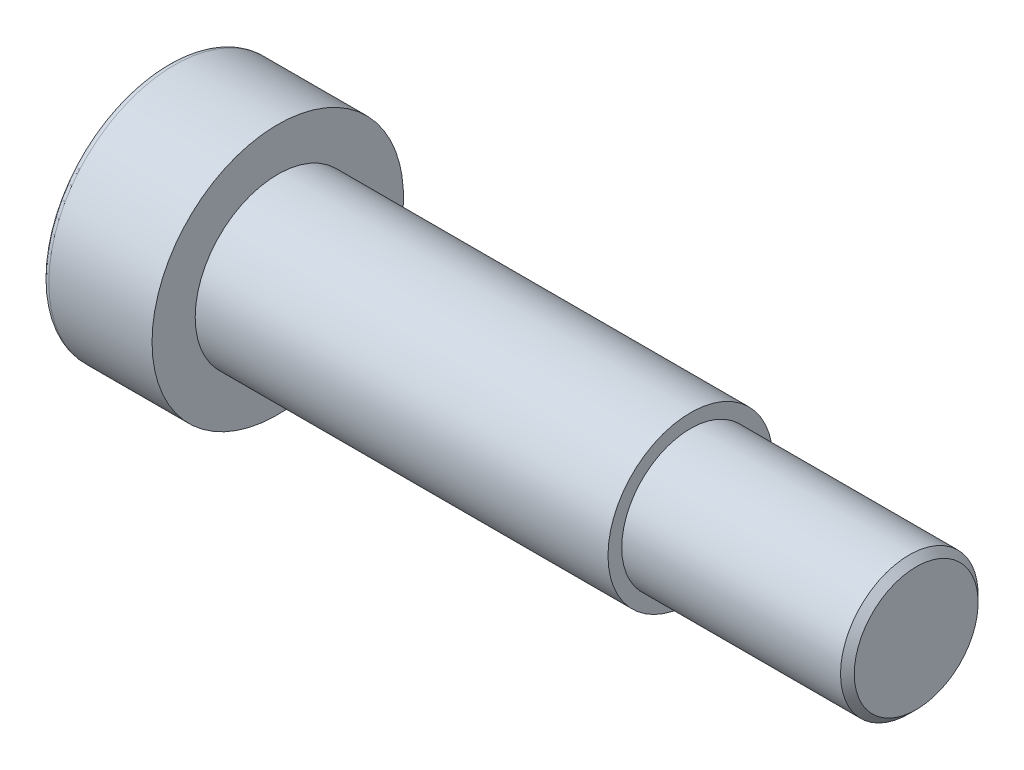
ISO-10303-21;
HEADER;
FILE_DESCRIPTION(('STEP AP214'),'2;1');
FILE_NAME('part.step','',(''),(''),'','','');
FILE_SCHEMA(('AUTOMOTIVE_DESIGN { 1 0 10303 214 1 1 1 1 }'));
ENDSEC;
DATA;
#1=APPLICATION_CONTEXT('core data for automotive mechanical design processes');
#2=APPLICATION_PROTOCOL_DEFINITION('international standard','automotive_design',2000,#1);
#3=PRODUCT_CONTEXT('',#1,'mechanical');
#4=PRODUCT('Part','Part','',(#3));
#5=PRODUCT_RELATED_PRODUCT_CATEGORY('part','',(#4));
#6=PRODUCT_DEFINITION_FORMATION('','',#4);
#7=PRODUCT_DEFINITION_CONTEXT('part definition',#1,'design');
#8=PRODUCT_DEFINITION('design','',#6,#7);
#9=PRODUCT_DEFINITION_SHAPE('','',#8);
#10=(LENGTH_UNIT() NAMED_UNIT(*) SI_UNIT(.MILLI.,.METRE.));
#11=(NAMED_UNIT(*) PLANE_ANGLE_UNIT() SI_UNIT($,.RADIAN.));
#12=(NAMED_UNIT(*) SI_UNIT($,.STERADIAN.) SOLID_ANGLE_UNIT());
#13=UNCERTAINTY_MEASURE_WITH_UNIT(LENGTH_MEASURE(1.E-05),#10,'distance_accuracy_value','');
#14=(GEOMETRIC_REPRESENTATION_CONTEXT(3) GLOBAL_UNCERTAINTY_ASSIGNED_CONTEXT((#13)) GLOBAL_UNIT_ASSIGNED_CONTEXT((#10,
#11,#12)) REPRESENTATION_CONTEXT('',''));
#15=CARTESIAN_POINT('',(0.,0.,0.));
#16=DIRECTION('',(0.,0.,1.));
#17=DIRECTION('',(1.,0.,0.));
#18=AXIS2_PLACEMENT_3D('',#15,#16,#17);
#19=CARTESIAN_POINT('',(54.4,5.,0.));
#20=DIRECTION('',(-1.,0.,0.));
#21=DIRECTION('',(0.,0.,1.));
#22=AXIS2_PLACEMENT_3D('',#19,#20,#21);
#23=PLANE('',#22);
#24=CARTESIAN_POINT('',(54.4,0.,0.));
#25=DIRECTION('',(-1.,0.,0.));
#26=DIRECTION('',(0.,0.,1.));
#27=AXIS2_PLACEMENT_3D('',#24,#25,#26);
#28=CIRCLE('',#27,4.50000000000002);
#29=CARTESIAN_POINT('',(54.4,0.,4.50000000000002));
#30=VERTEX_POINT('',#29);
#31=EDGE_CURVE('E157',#30,#30,#28,.F.);
#32=ORIENTED_EDGE('',*,*,#31,.T.);
#33=EDGE_LOOP('',(#32));
#34=FACE_BOUND('',#33,.T.);
#35=ADVANCED_FACE('F34',(#34),#23,.F.);
#36=CARTESIAN_POINT('',(-16.7790823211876,0.,0.));
#37=DIRECTION('',(-1.,0.,0.));
#38=DIRECTION('',(0.,0.,1.));
#39=AXIS2_PLACEMENT_3D('',#36,#37,#38);
#40=CYLINDRICAL_SURFACE('',#39,5.);
#41=CARTESIAN_POINT('',(53.9,0.,0.));
#42=DIRECTION('',(-1.,0.,0.));
#43=DIRECTION('',(0.,0.,1.));
#44=AXIS2_PLACEMENT_3D('',#41,#42,#43);
#45=CIRCLE('',#44,5.);
#46=CARTESIAN_POINT('',(53.9,0.,5.));
#47=VERTEX_POINT('',#46);
#48=EDGE_CURVE('E154',#47,#47,#45,.T.);
#49=ORIENTED_EDGE('',*,*,#48,.T.);
#50=EDGE_LOOP('',(#49));
#51=FACE_BOUND('',#50,.T.);
#52=CARTESIAN_POINT('',(38.,0.,0.));
#53=DIRECTION('',(-1.,0.,0.));
#54=DIRECTION('',(0.,0.,1.));
#55=AXIS2_PLACEMENT_3D('',#52,#53,#54);
#56=CIRCLE('',#55,5.);
#57=CARTESIAN_POINT('',(38.,0.,5.));
#58=VERTEX_POINT('',#57);
#59=EDGE_CURVE('E151',#58,#58,#56,.T.);
#60=ORIENTED_EDGE('',*,*,#59,.F.);
#61=EDGE_LOOP('',(#60));
#62=FACE_BOUND('',#61,.T.);
#63=ADVANCED_FACE('F178',(#51,#62),#40,.T.);
#64=CARTESIAN_POINT('',(38.,6.,0.));
#65=DIRECTION('',(-1.,0.,0.));
#66=DIRECTION('',(0.,0.,1.));
#67=AXIS2_PLACEMENT_3D('',#64,#65,#66);
#68=PLANE('',#67);
#69=CARTESIAN_POINT('',(38.,0.,0.));
#70=DIRECTION('',(-1.,0.,0.));
#71=DIRECTION('',(0.,0.,1.));
#72=AXIS2_PLACEMENT_3D('',#69,#70,#71);
#73=CIRCLE('',#72,6.);
#74=CARTESIAN_POINT('',(38.,0.,6.));
#75=VERTEX_POINT('',#74);
#76=EDGE_CURVE('E148',#75,#75,#73,.T.);
#77=ORIENTED_EDGE('',*,*,#76,.F.);
#78=EDGE_LOOP('',(#77));
#79=FACE_BOUND('',#78,.T.);
#80=ORIENTED_EDGE('',*,*,#59,.T.);
#81=EDGE_LOOP('',(#80));
#82=FACE_BOUND('',#81,.T.);
#83=ADVANCED_FACE('F183',(#79,#82),#68,.F.);
#84=CARTESIAN_POINT('',(-16.7790823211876,0.,0.));
#85=DIRECTION('',(-1.,0.,0.));
#86=DIRECTION('',(0.,0.,1.));
#87=AXIS2_PLACEMENT_3D('',#84,#85,#86);
#88=CYLINDRICAL_SURFACE('',#87,6.);
#89=CARTESIAN_POINT('',(8.,0.,0.));
#90=DIRECTION('',(-1.,0.,0.));
#91=DIRECTION('',(0.,0.,1.));
#92=AXIS2_PLACEMENT_3D('',#89,#90,#91);
#93=CIRCLE('',#92,6.);
#94=CARTESIAN_POINT('',(8.,0.,6.));
#95=VERTEX_POINT('',#94);
#96=EDGE_CURVE('E145',#95,#95,#93,.T.);
#97=ORIENTED_EDGE('',*,*,#96,.F.);
#98=EDGE_LOOP('',(#97));
#99=FACE_BOUND('',#98,.T.);
#100=ORIENTED_EDGE('',*,*,#76,.T.);
#101=EDGE_LOOP('',(#100));
#102=FACE_BOUND('',#101,.T.);
#103=ADVANCED_FACE('F192',(#99,#102),#88,.T.);
#104=CARTESIAN_POINT('',(8.,9.135,0.));
#105=DIRECTION('',(-1.,0.,0.));
#106=DIRECTION('',(0.,0.,1.));
#107=AXIS2_PLACEMENT_3D('',#104,#105,#106);
#108=PLANE('',#107);
#109=CARTESIAN_POINT('',(8.,0.,0.));
#110=DIRECTION('',(-1.,0.,0.));
#111=DIRECTION('',(0.,0.,1.));
#112=AXIS2_PLACEMENT_3D('',#109,#110,#111);
#113=CIRCLE('',#112,9.135);
#114=CARTESIAN_POINT('',(8.,0.,9.135));
#115=VERTEX_POINT('',#114);
#116=EDGE_CURVE('E136',#115,#115,#113,.T.);
#117=ORIENTED_EDGE('',*,*,#116,.F.);
#118=EDGE_LOOP('',(#117));
#119=FACE_BOUND('',#118,.T.);
#120=ORIENTED_EDGE('',*,*,#96,.T.);
#121=EDGE_LOOP('',(#120));
#122=FACE_BOUND('',#121,.T.);
#123=ADVANCED_FACE('F198',(#119,#122),#108,.F.);
#124=CARTESIAN_POINT('',(-16.7790823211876,0.,0.));
#125=DIRECTION('',(-1.,0.,0.));
#126=DIRECTION('',(0.,0.,1.));
#127=AXIS2_PLACEMENT_3D('',#124,#125,#126);
#128=CYLINDRICAL_SURFACE('',#127,9.135);
#129=CARTESIAN_POINT('',(0.5,0.,0.));
#130=DIRECTION('',(1.,0.,0.));
#131=DIRECTION('',(0.,0.,-1.));
#132=AXIS2_PLACEMENT_3D('',#129,#130,#131);
#133=CIRCLE('',#132,9.135);
#134=CARTESIAN_POINT('',(0.5,0.,-9.135));
#135=VERTEX_POINT('',#134);
#136=EDGE_CURVE('E11',#135,#135,#133,.T.);
#137=ORIENTED_EDGE('',*,*,#136,.T.);
#138=EDGE_LOOP('',(#137));
#139=FACE_BOUND('',#138,.T.);
#140=ORIENTED_EDGE('',*,*,#116,.T.);
#141=EDGE_LOOP('',(#140));
#142=FACE_BOUND('',#141,.T.);
#143=ADVANCED_FACE('F205',(#139,#142),#128,.T.);
#144=CARTESIAN_POINT('',(0.,0.,0.));
#145=DIRECTION('',(1.,0.,0.));
#146=DIRECTION('',(0.,0.,-1.));
#147=AXIS2_PLACEMENT_3D('',#144,#145,#146);
#148=PLANE('',#147);
#149=DIRECTION('',(0.,-0.86602540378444,0.499999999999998));
#150=VECTOR('',#149,1.);
#151=CARTESIAN_POINT('',(0.,0.,-3.46410161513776));
#152=LINE('',#151,#150);
#153=CARTESIAN_POINT('',(0.,0.,-3.46410161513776));
#154=VERTEX_POINT('',#153);
#155=CARTESIAN_POINT('',(0.,-3.,-1.73205080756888));
#156=VERTEX_POINT('',#155);
#157=EDGE_CURVE('E102',#154,#156,#152,.T.);
#158=ORIENTED_EDGE('',*,*,#157,.F.);
#159=DIRECTION('',(0.,-0.866025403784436,-0.500000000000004));
#160=VECTOR('',#159,1.);
#161=CARTESIAN_POINT('',(0.,3.,-1.73205080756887));
#162=LINE('',#161,#160);
#163=CARTESIAN_POINT('',(0.,3.,-1.73205080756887));
#164=VERTEX_POINT('',#163);
#165=EDGE_CURVE('E48',#164,#154,#162,.T.);
#166=ORIENTED_EDGE('',*,*,#165,.F.);
#167=DIRECTION('',(0.,0.,-1.));
#168=VECTOR('',#167,1.);
#169=CARTESIAN_POINT('',(0.,3.,-1.73205080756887));
#170=LINE('',#169,#168);
#171=CARTESIAN_POINT('',(0.,3.,1.73205080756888));
#172=VERTEX_POINT('',#171);
#173=EDGE_CURVE('E118',#172,#164,#170,.T.);
#174=ORIENTED_EDGE('',*,*,#173,.F.);
#175=DIRECTION('',(0.,0.86602540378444,-0.499999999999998));
#176=VECTOR('',#175,1.);
#177=CARTESIAN_POINT('',(0.,3.,1.73205080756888));
#178=LINE('',#177,#176);
#179=CARTESIAN_POINT('',(0.,0.,3.46410161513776));
#180=VERTEX_POINT('',#179);
#181=EDGE_CURVE('E112',#180,#172,#178,.T.);
#182=ORIENTED_EDGE('',*,*,#181,.F.);
#183=DIRECTION('',(0.,0.866025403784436,0.500000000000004));
#184=VECTOR('',#183,1.);
#185=CARTESIAN_POINT('',(0.,0.,3.46410161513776));
#186=LINE('',#185,#184);
#187=CARTESIAN_POINT('',(0.,-3.,1.73205080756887));
#188=VERTEX_POINT('',#187);
#189=EDGE_CURVE('E110',#188,#180,#186,.T.);
#190=ORIENTED_EDGE('',*,*,#189,.F.);
#191=DIRECTION('',(0.,0.,1.));
#192=VECTOR('',#191,1.);
#193=CARTESIAN_POINT('',(0.,-3.,-1.73205080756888));
#194=LINE('',#193,#192);
#195=EDGE_CURVE('E91',#156,#188,#194,.T.);
#196=ORIENTED_EDGE('',*,*,#195,.F.);
#197=EDGE_LOOP('',(#158,#166,#174,#182,#190,#196));
#198=FACE_BOUND('',#197,.T.);
#199=CARTESIAN_POINT('',(0.,0.,0.));
#200=DIRECTION('',(1.,0.,0.));
#201=DIRECTION('',(0.,0.,-1.));
#202=AXIS2_PLACEMENT_3D('',#199,#200,#201);
#203=CIRCLE('',#202,8.635);
#204=CARTESIAN_POINT('',(0.,0.,-8.635));
#205=VERTEX_POINT('',#204);
#206=EDGE_CURVE('E41',#205,#205,#203,.F.);
#207=ORIENTED_EDGE('',*,*,#206,.T.);
#208=EDGE_LOOP('',(#207));
#209=FACE_BOUND('',#208,.T.);
#210=ADVANCED_FACE('F106',(#198,#209),#148,.F.);
#211=CARTESIAN_POINT('',(53.9,0.,0.));
#212=DIRECTION('',(-1.,0.,0.));
#213=DIRECTION('',(0.,0.,1.));
#214=AXIS2_PLACEMENT_3D('',#211,#212,#213);
#215=CONICAL_SURFACE('',#214,5.,0.785398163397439);
#216=ORIENTED_EDGE('',*,*,#31,.F.);
#217=EDGE_LOOP('',(#216));
#218=FACE_BOUND('',#217,.T.);
#219=ORIENTED_EDGE('',*,*,#48,.F.);
#220=EDGE_LOOP('',(#219));
#221=FACE_BOUND('',#220,.T.);
#222=ADVANCED_FACE('F165',(#218,#221),#215,.T.);
#223=CARTESIAN_POINT('',(0.5,0.,0.));
#224=DIRECTION('',(1.,0.,0.));
#225=DIRECTION('',(0.,0.,-1.));
#226=AXIS2_PLACEMENT_3D('',#223,#224,#225);
#227=TOROIDAL_SURFACE('',#226,8.635,0.5);
#228=ORIENTED_EDGE('',*,*,#136,.F.);
#229=EDGE_LOOP('',(#228));
#230=FACE_BOUND('',#229,.T.);
#231=ORIENTED_EDGE('',*,*,#206,.F.);
#232=EDGE_LOOP('',(#231));
#233=FACE_BOUND('',#232,.T.);
#234=ADVANCED_FACE('F162',(#230,#233),#227,.T.);
#235=CARTESIAN_POINT('',(5.,3.,-1.73205080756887));
#236=DIRECTION('',(0.,0.500000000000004,-0.866025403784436));
#237=DIRECTION('',(0.,0.866025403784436,0.500000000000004));
#238=AXIS2_PLACEMENT_3D('',#235,#236,#237);
#239=PLANE('',#238);
#240=ORIENTED_EDGE('',*,*,#165,.T.);
#241=DIRECTION('',(-1.,0.,0.));
#242=VECTOR('',#241,1.);
#243=CARTESIAN_POINT('',(5.,0.,-3.46410161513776));
#244=LINE('',#243,#242);
#245=CARTESIAN_POINT('',(5.,0.,-3.46410161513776));
#246=VERTEX_POINT('',#245);
#247=EDGE_CURVE('E99',#246,#154,#244,.T.);
#248=ORIENTED_EDGE('',*,*,#247,.F.);
#249=DIRECTION('',(0.,-0.866025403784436,-0.500000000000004));
#250=VECTOR('',#249,1.);
#251=CARTESIAN_POINT('',(5.,3.,-1.73205080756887));
#252=LINE('',#251,#250);
#253=CARTESIAN_POINT('',(5.,3.,-1.73205080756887));
#254=VERTEX_POINT('',#253);
#255=EDGE_CURVE('E120',#254,#246,#252,.T.);
#256=ORIENTED_EDGE('',*,*,#255,.F.);
#257=DIRECTION('',(-1.,0.,0.));
#258=VECTOR('',#257,1.);
#259=CARTESIAN_POINT('',(5.,3.,-1.73205080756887));
#260=LINE('',#259,#258);
#261=EDGE_CURVE('E55',#254,#164,#260,.T.);
#262=ORIENTED_EDGE('',*,*,#261,.T.);
#263=EDGE_LOOP('',(#240,#248,#256,#262));
#264=FACE_BOUND('',#263,.T.);
#265=ADVANCED_FACE('F164',(#264),#239,.F.);
#266=CARTESIAN_POINT('',(5.,3.,-1.73205080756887));
#267=DIRECTION('',(0.,1.,0.));
#268=DIRECTION('',(0.,0.,1.));
#269=AXIS2_PLACEMENT_3D('',#266,#267,#268);
#270=PLANE('',#269);
#271=ORIENTED_EDGE('',*,*,#173,.T.);
#272=ORIENTED_EDGE('',*,*,#261,.F.);
#273=DIRECTION('',(0.,0.,-1.));
#274=VECTOR('',#273,1.);
#275=CARTESIAN_POINT('',(5.,3.,-1.73205080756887));
#276=LINE('',#275,#274);
#277=CARTESIAN_POINT('',(5.,3.,1.73205080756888));
#278=VERTEX_POINT('',#277);
#279=EDGE_CURVE('E132',#278,#254,#276,.T.);
#280=ORIENTED_EDGE('',*,*,#279,.F.);
#281=DIRECTION('',(-1.,0.,0.));
#282=VECTOR('',#281,1.);
#283=CARTESIAN_POINT('',(5.,3.,1.73205080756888));
#284=LINE('',#283,#282);
#285=EDGE_CURVE('E137',#278,#172,#284,.T.);
#286=ORIENTED_EDGE('',*,*,#285,.T.);
#287=EDGE_LOOP('',(#271,#272,#280,#286));
#288=FACE_BOUND('',#287,.T.);
#289=ADVANCED_FACE('F172',(#288),#270,.F.);
#290=CARTESIAN_POINT('',(5.,3.,1.73205080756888));
#291=DIRECTION('',(0.,0.499999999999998,0.86602540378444));
#292=DIRECTION('',(0.,-0.86602540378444,0.499999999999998));
#293=AXIS2_PLACEMENT_3D('',#290,#291,#292);
#294=PLANE('',#293);
#295=ORIENTED_EDGE('',*,*,#181,.T.);
#296=ORIENTED_EDGE('',*,*,#285,.F.);
#297=DIRECTION('',(0.,0.86602540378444,-0.499999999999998));
#298=VECTOR('',#297,1.);
#299=CARTESIAN_POINT('',(5.,3.,1.73205080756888));
#300=LINE('',#299,#298);
#301=CARTESIAN_POINT('',(5.,0.,3.46410161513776));
#302=VERTEX_POINT('',#301);
#303=EDGE_CURVE('E129',#302,#278,#300,.T.);
#304=ORIENTED_EDGE('',*,*,#303,.F.);
#305=DIRECTION('',(-1.,0.,0.));
#306=VECTOR('',#305,1.);
#307=CARTESIAN_POINT('',(5.,0.,3.46410161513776));
#308=LINE('',#307,#306);
#309=EDGE_CURVE('E139',#302,#180,#308,.T.);
#310=ORIENTED_EDGE('',*,*,#309,.T.);
#311=EDGE_LOOP('',(#295,#296,#304,#310));
#312=FACE_BOUND('',#311,.T.);
#313=ADVANCED_FACE('F246',(#312),#294,.F.);
#314=CARTESIAN_POINT('',(5.,0.,3.46410161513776));
#315=DIRECTION('',(0.,-0.500000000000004,0.866025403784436));
#316=DIRECTION('',(0.,-0.866025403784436,-0.500000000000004));
#317=AXIS2_PLACEMENT_3D('',#314,#315,#316);
#318=PLANE('',#317);
#319=ORIENTED_EDGE('',*,*,#189,.T.);
#320=ORIENTED_EDGE('',*,*,#309,.F.);
#321=DIRECTION('',(0.,0.866025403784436,0.500000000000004));
#322=VECTOR('',#321,1.);
#323=CARTESIAN_POINT('',(5.,0.,3.46410161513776));
#324=LINE('',#323,#322);
#325=CARTESIAN_POINT('',(5.,-3.,1.73205080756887));
#326=VERTEX_POINT('',#325);
#327=EDGE_CURVE('E126',#326,#302,#324,.T.);
#328=ORIENTED_EDGE('',*,*,#327,.F.);
#329=DIRECTION('',(-1.,0.,0.));
#330=VECTOR('',#329,1.);
#331=CARTESIAN_POINT('',(5.,-3.,1.73205080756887));
#332=LINE('',#331,#330);
#333=EDGE_CURVE('E98',#326,#188,#332,.T.);
#334=ORIENTED_EDGE('',*,*,#333,.T.);
#335=EDGE_LOOP('',(#319,#320,#328,#334));
#336=FACE_BOUND('',#335,.T.);
#337=ADVANCED_FACE('F254',(#336),#318,.F.);
#338=CARTESIAN_POINT('',(5.,-3.,-1.73205080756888));
#339=DIRECTION('',(0.,-1.,0.));
#340=DIRECTION('',(0.,0.,-1.));
#341=AXIS2_PLACEMENT_3D('',#338,#339,#340);
#342=PLANE('',#341);
#343=ORIENTED_EDGE('',*,*,#195,.T.);
#344=ORIENTED_EDGE('',*,*,#333,.F.);
#345=DIRECTION('',(0.,0.,1.));
#346=VECTOR('',#345,1.);
#347=CARTESIAN_POINT('',(5.,-3.,-1.73205080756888));
#348=LINE('',#347,#346);
#349=CARTESIAN_POINT('',(5.,-3.,-1.73205080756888));
#350=VERTEX_POINT('',#349);
#351=EDGE_CURVE('E94',#350,#326,#348,.T.);
#352=ORIENTED_EDGE('',*,*,#351,.F.);
#353=DIRECTION('',(-1.,0.,0.));
#354=VECTOR('',#353,1.);
#355=CARTESIAN_POINT('',(5.,-3.,-1.73205080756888));
#356=LINE('',#355,#354);
#357=EDGE_CURVE('E87',#350,#156,#356,.T.);
#358=ORIENTED_EDGE('',*,*,#357,.T.);
#359=EDGE_LOOP('',(#343,#344,#352,#358));
#360=FACE_BOUND('',#359,.T.);
#361=ADVANCED_FACE('F89',(#360),#342,.F.);
#362=CARTESIAN_POINT('',(5.,0.,-3.46410161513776));
#363=DIRECTION('',(0.,-0.499999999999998,-0.86602540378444));
#364=DIRECTION('',(0.,0.86602540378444,-0.499999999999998));
#365=AXIS2_PLACEMENT_3D('',#362,#363,#364);
#366=PLANE('',#365);
#367=ORIENTED_EDGE('',*,*,#157,.T.);
#368=ORIENTED_EDGE('',*,*,#357,.F.);
#369=DIRECTION('',(0.,-0.86602540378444,0.499999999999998));
#370=VECTOR('',#369,1.);
#371=CARTESIAN_POINT('',(5.,0.,-3.46410161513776));
#372=LINE('',#371,#370);
#373=EDGE_CURVE('E123',#246,#350,#372,.T.);
#374=ORIENTED_EDGE('',*,*,#373,.F.);
#375=ORIENTED_EDGE('',*,*,#247,.T.);
#376=EDGE_LOOP('',(#367,#368,#374,#375));
#377=FACE_BOUND('',#376,.T.);
#378=ADVANCED_FACE('F103',(#377),#366,.F.);
#379=CARTESIAN_POINT('',(5.,0.,-3.46410161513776));
#380=DIRECTION('',(-1.,0.,0.));
#381=DIRECTION('',(0.,0.,1.));
#382=AXIS2_PLACEMENT_3D('',#379,#380,#381);
#383=PLANE('',#382);
#384=ORIENTED_EDGE('',*,*,#255,.T.);
#385=ORIENTED_EDGE('',*,*,#373,.T.);
#386=ORIENTED_EDGE('',*,*,#351,.T.);
#387=ORIENTED_EDGE('',*,*,#327,.T.);
#388=ORIENTED_EDGE('',*,*,#303,.T.);
#389=ORIENTED_EDGE('',*,*,#279,.T.);
#390=EDGE_LOOP('',(#384,#385,#386,#387,#388,#389));
#391=FACE_BOUND('',#390,.T.);
#392=ADVANCED_FACE('F278',(#391),#383,.T.);
#393=CLOSED_SHELL('',(#35,#63,#83,#103,#123,#143,#210,#222,#234,#265,#289,#313,#337,#361,#378,#392));
#394=MANIFOLD_SOLID_BREP('B2',#393);
#395=ADVANCED_BREP_SHAPE_REPRESENTATION('',(#18,#394),#14);
#396=SHAPE_DEFINITION_REPRESENTATION(#9,#395);
ENDSEC;
END-ISO-10303-21;
